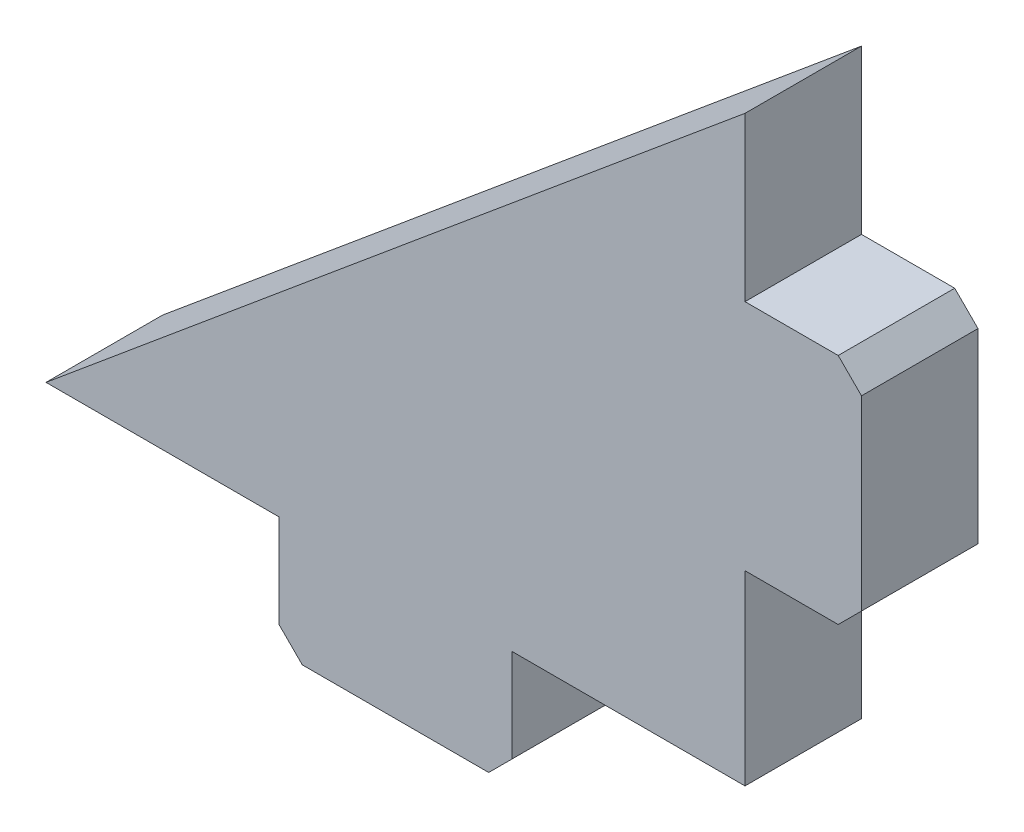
from build123d import *

# Parameters (mm, degrees)
BOSS_EXTRU_1_DEPTH = 5
CHANFREIN1_SIZE    = 1


with BuildPart() as part:
    # Esquisse1 → Boss.-Extru.1 (new body)
    with BuildSketch(Plane.XY):
        Polygon((-30, 0), (-20, 0), (-20, -5), (-10, -5), (-10, 0), (0, 0), (0, 8), (5, 8), (5, 18), (0, 18), (0, 25), align=None)
    extrude(amount=BOSS_EXTRU_1_DEPTH)

    # Chanfrein1
    chanfrein1_edges = [part.edges().sort_by_distance(p)[0] for p in [
        (5, 18, 2.5),
        (5, 8, 2.5),
        (-10, -5, 2.5),
        (-20, -5, 2.5),
    ]]
    chamfer(chanfrein1_edges, length=CHANFREIN1_SIZE)


solid = part.part
